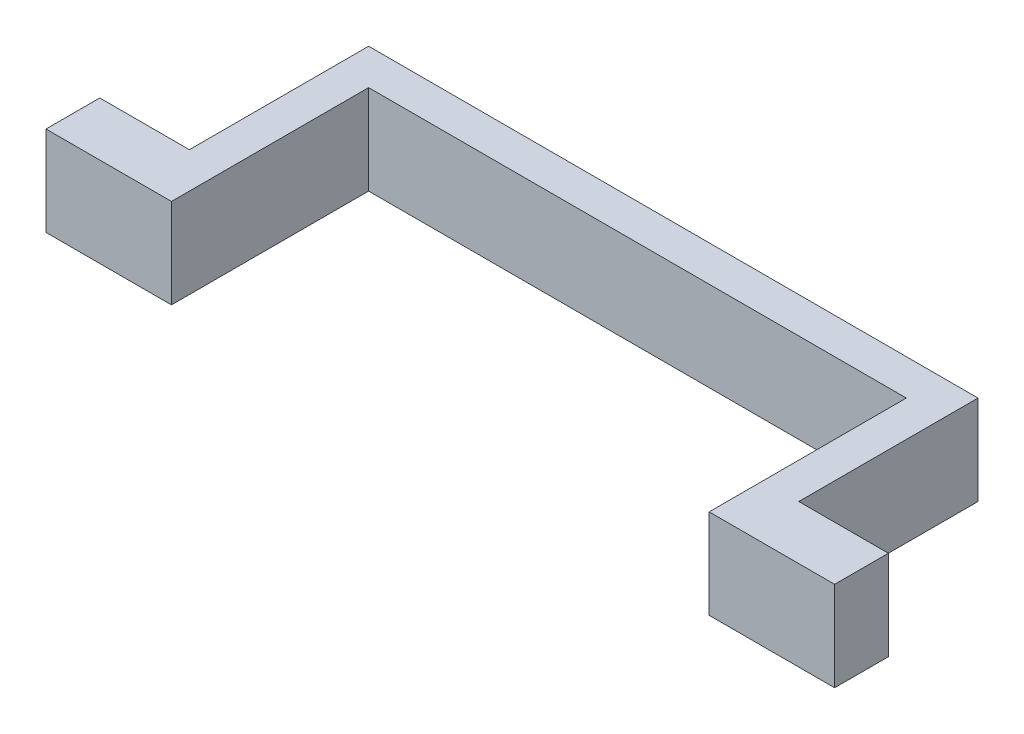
ISO-10303-21;
HEADER;
FILE_DESCRIPTION(('STEP AP214'),'2;1');
FILE_NAME('part.step','',(''),(''),'','','');
FILE_SCHEMA(('AUTOMOTIVE_DESIGN { 1 0 10303 214 1 1 1 1 }'));
ENDSEC;
DATA;
#1=APPLICATION_CONTEXT('core data for automotive mechanical design processes');
#2=APPLICATION_PROTOCOL_DEFINITION('international standard','automotive_design',2000,#1);
#3=PRODUCT_CONTEXT('',#1,'mechanical');
#4=PRODUCT('Part','Part','',(#3));
#5=PRODUCT_RELATED_PRODUCT_CATEGORY('part','',(#4));
#6=PRODUCT_DEFINITION_FORMATION('','',#4);
#7=PRODUCT_DEFINITION_CONTEXT('part definition',#1,'design');
#8=PRODUCT_DEFINITION('design','',#6,#7);
#9=PRODUCT_DEFINITION_SHAPE('','',#8);
#10=(LENGTH_UNIT() NAMED_UNIT(*) SI_UNIT(.MILLI.,.METRE.));
#11=(NAMED_UNIT(*) PLANE_ANGLE_UNIT() SI_UNIT($,.RADIAN.));
#12=(NAMED_UNIT(*) SI_UNIT($,.STERADIAN.) SOLID_ANGLE_UNIT());
#13=UNCERTAINTY_MEASURE_WITH_UNIT(LENGTH_MEASURE(1.E-05),#10,'distance_accuracy_value','');
#14=(GEOMETRIC_REPRESENTATION_CONTEXT(3) GLOBAL_UNCERTAINTY_ASSIGNED_CONTEXT((#13)) GLOBAL_UNIT_ASSIGNED_CONTEXT((#10,
#11,#12)) REPRESENTATION_CONTEXT('',''));
#15=CARTESIAN_POINT('',(0.,0.,0.));
#16=DIRECTION('',(0.,0.,1.));
#17=DIRECTION('',(1.,0.,0.));
#18=AXIS2_PLACEMENT_3D('',#15,#16,#17);
#19=CARTESIAN_POINT('',(11.3973290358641,-3.51084583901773,2.));
#20=DIRECTION('',(0.,0.,-1.));
#21=DIRECTION('',(-1.,0.,0.));
#22=AXIS2_PLACEMENT_3D('',#19,#20,#21);
#23=PLANE('',#22);
#24=DIRECTION('',(0.,-1.,0.));
#25=VECTOR('',#24,1.);
#26=CARTESIAN_POINT('',(43.3973290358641,-8.51084583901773,2.));
#27=LINE('',#26,#25);
#28=CARTESIAN_POINT('',(43.3973290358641,-3.51084583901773,2.));
#29=VERTEX_POINT('',#28);
#30=CARTESIAN_POINT('',(43.3973290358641,-8.51084583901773,2.));
#31=VERTEX_POINT('',#30);
#32=EDGE_CURVE('E203',#29,#31,#27,.T.);
#33=ORIENTED_EDGE('',*,*,#32,.F.);
#34=DIRECTION('',(-1.,0.,0.));
#35=VECTOR('',#34,1.);
#36=CARTESIAN_POINT('',(11.3973290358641,-3.51084583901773,2.));
#37=LINE('',#36,#35);
#38=CARTESIAN_POINT('',(13.3973290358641,-3.51084583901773,2.));
#39=VERTEX_POINT('',#38);
#40=EDGE_CURVE('E164',#29,#39,#37,.T.);
#41=ORIENTED_EDGE('',*,*,#40,.T.);
#42=DIRECTION('',(0.,1.,0.));
#43=VECTOR('',#42,1.);
#44=CARTESIAN_POINT('',(13.3973290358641,-3.51084583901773,2.));
#45=LINE('',#44,#43);
#46=CARTESIAN_POINT('',(13.3973290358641,-8.51084583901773,2.));
#47=VERTEX_POINT('',#46);
#48=EDGE_CURVE('E221',#47,#39,#45,.T.);
#49=ORIENTED_EDGE('',*,*,#48,.F.);
#50=DIRECTION('',(1.,0.,0.));
#51=VECTOR('',#50,1.);
#52=CARTESIAN_POINT('',(11.3973290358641,-8.51084583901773,2.));
#53=LINE('',#52,#51);
#54=EDGE_CURVE('E179',#47,#31,#53,.T.);
#55=ORIENTED_EDGE('',*,*,#54,.T.);
#56=EDGE_LOOP('',(#33,#41,#49,#55));
#57=FACE_BOUND('',#56,.T.);
#58=ADVANCED_FACE('F33',(#57),#23,.F.);
#59=CARTESIAN_POINT('',(11.3973290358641,-8.51084583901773,2.));
#60=DIRECTION('',(1.,0.,0.));
#61=DIRECTION('',(0.,0.,-1.));
#62=AXIS2_PLACEMENT_3D('',#59,#60,#61);
#63=PLANE('',#62);
#64=DIRECTION('',(0.,0.,-1.));
#65=VECTOR('',#64,1.);
#66=CARTESIAN_POINT('',(11.3973290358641,-8.51084583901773,2.));
#67=LINE('',#66,#65);
#68=CARTESIAN_POINT('',(11.3973290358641,-8.51084583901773,10.));
#69=VERTEX_POINT('',#68);
#70=CARTESIAN_POINT('',(11.3973290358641,-8.51084583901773,0.));
#71=VERTEX_POINT('',#70);
#72=EDGE_CURVE('E11',#69,#71,#67,.T.);
#73=ORIENTED_EDGE('',*,*,#72,.F.);
#74=DIRECTION('',(0.,1.,0.));
#75=VECTOR('',#74,1.);
#76=CARTESIAN_POINT('',(11.3973290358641,-3.51084583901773,10.));
#77=LINE('',#76,#75);
#78=CARTESIAN_POINT('',(11.3973290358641,-3.51084583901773,10.));
#79=VERTEX_POINT('',#78);
#80=EDGE_CURVE('E186',#69,#79,#77,.T.);
#81=ORIENTED_EDGE('',*,*,#80,.T.);
#82=DIRECTION('',(0.,0.,-1.));
#83=VECTOR('',#82,1.);
#84=CARTESIAN_POINT('',(11.3973290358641,-3.51084583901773,2.));
#85=LINE('',#84,#83);
#86=CARTESIAN_POINT('',(11.3973290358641,-3.51084583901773,0.));
#87=VERTEX_POINT('',#86);
#88=EDGE_CURVE('E162',#79,#87,#85,.T.);
#89=ORIENTED_EDGE('',*,*,#88,.T.);
#90=DIRECTION('',(0.,-1.,0.));
#91=VECTOR('',#90,1.);
#92=CARTESIAN_POINT('',(11.3973290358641,-8.51084583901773,0.));
#93=LINE('',#92,#91);
#94=EDGE_CURVE('E239',#87,#71,#93,.T.);
#95=ORIENTED_EDGE('',*,*,#94,.T.);
#96=EDGE_LOOP('',(#73,#81,#89,#95));
#97=FACE_BOUND('',#96,.T.);
#98=ADVANCED_FACE('F35',(#97),#63,.F.);
#99=CARTESIAN_POINT('',(11.3973290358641,-8.51084583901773,2.));
#100=DIRECTION('',(0.,1.,0.));
#101=DIRECTION('',(0.,0.,1.));
#102=AXIS2_PLACEMENT_3D('',#99,#100,#101);
#103=PLANE('',#102);
#104=DIRECTION('',(1.,0.,0.));
#105=VECTOR('',#104,1.);
#106=CARTESIAN_POINT('',(11.3973290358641,-8.51084583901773,0.));
#107=LINE('',#106,#105);
#108=CARTESIAN_POINT('',(45.3973290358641,-8.51084583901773,0.));
#109=VERTEX_POINT('',#108);
#110=EDGE_CURVE('E245',#71,#109,#107,.T.);
#111=ORIENTED_EDGE('',*,*,#110,.T.);
#112=DIRECTION('',(0.,0.,-1.));
#113=VECTOR('',#112,1.);
#114=CARTESIAN_POINT('',(45.3973290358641,-8.51084583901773,2.));
#115=LINE('',#114,#113);
#116=CARTESIAN_POINT('',(45.3973290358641,-8.51084583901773,10.));
#117=VERTEX_POINT('',#116);
#118=EDGE_CURVE('E42',#117,#109,#115,.T.);
#119=ORIENTED_EDGE('',*,*,#118,.F.);
#120=DIRECTION('',(1.,0.,0.));
#121=VECTOR('',#120,1.);
#122=CARTESIAN_POINT('',(45.3973290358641,-8.51084583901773,10.));
#123=LINE('',#122,#121);
#124=CARTESIAN_POINT('',(50.3973290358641,-8.51084583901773,10.));
#125=VERTEX_POINT('',#124);
#126=EDGE_CURVE('E50',#117,#125,#123,.T.);
#127=ORIENTED_EDGE('',*,*,#126,.T.);
#128=DIRECTION('',(0.,0.,1.));
#129=VECTOR('',#128,1.);
#130=CARTESIAN_POINT('',(50.3973290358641,-8.51084583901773,10.));
#131=LINE('',#130,#129);
#132=CARTESIAN_POINT('',(50.3973290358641,-8.51084583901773,13.));
#133=VERTEX_POINT('',#132);
#134=EDGE_CURVE('E126',#125,#133,#131,.T.);
#135=ORIENTED_EDGE('',*,*,#134,.T.);
#136=DIRECTION('',(1.,0.,0.));
#137=VECTOR('',#136,1.);
#138=CARTESIAN_POINT('',(45.3973290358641,-8.51084583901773,13.));
#139=LINE('',#138,#137);
#140=CARTESIAN_POINT('',(43.3973290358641,-8.51084583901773,13.));
#141=VERTEX_POINT('',#140);
#142=EDGE_CURVE('E211',#141,#133,#139,.T.);
#143=ORIENTED_EDGE('',*,*,#142,.F.);
#144=DIRECTION('',(0.,0.,-1.));
#145=VECTOR('',#144,1.);
#146=CARTESIAN_POINT('',(43.3973290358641,-8.51084583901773,13.));
#147=LINE('',#146,#145);
#148=EDGE_CURVE('E213',#141,#31,#147,.T.);
#149=ORIENTED_EDGE('',*,*,#148,.T.);
#150=ORIENTED_EDGE('',*,*,#54,.F.);
#151=DIRECTION('',(0.,0.,-1.));
#152=VECTOR('',#151,1.);
#153=CARTESIAN_POINT('',(13.3973290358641,-8.51084583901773,13.));
#154=LINE('',#153,#152);
#155=CARTESIAN_POINT('',(13.3973290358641,-8.51084583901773,13.));
#156=VERTEX_POINT('',#155);
#157=EDGE_CURVE('E235',#156,#47,#154,.T.);
#158=ORIENTED_EDGE('',*,*,#157,.F.);
#159=DIRECTION('',(1.,0.,0.));
#160=VECTOR('',#159,1.);
#161=CARTESIAN_POINT('',(11.3973290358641,-8.51084583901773,13.));
#162=LINE('',#161,#160);
#163=CARTESIAN_POINT('',(6.39732903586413,-8.51084583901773,13.));
#164=VERTEX_POINT('',#163);
#165=EDGE_CURVE('E222',#164,#156,#162,.T.);
#166=ORIENTED_EDGE('',*,*,#165,.F.);
#167=DIRECTION('',(0.,0.,1.));
#168=VECTOR('',#167,1.);
#169=CARTESIAN_POINT('',(6.39732903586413,-8.51084583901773,10.));
#170=LINE('',#169,#168);
#171=CARTESIAN_POINT('',(6.39732903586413,-8.51084583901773,10.));
#172=VERTEX_POINT('',#171);
#173=EDGE_CURVE('E200',#172,#164,#170,.T.);
#174=ORIENTED_EDGE('',*,*,#173,.F.);
#175=DIRECTION('',(1.,0.,0.));
#176=VECTOR('',#175,1.);
#177=CARTESIAN_POINT('',(11.3973290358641,-8.51084583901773,10.));
#178=LINE('',#177,#176);
#179=EDGE_CURVE('E197',#172,#69,#178,.T.);
#180=ORIENTED_EDGE('',*,*,#179,.T.);
#181=ORIENTED_EDGE('',*,*,#72,.T.);
#182=EDGE_LOOP('',(#111,#119,#127,#135,#143,#149,#150,#158,#166,#174,#180,#181));
#183=FACE_BOUND('',#182,.T.);
#184=ADVANCED_FACE('F143',(#183),#103,.F.);
#185=CARTESIAN_POINT('',(45.3973290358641,-8.51084583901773,2.));
#186=DIRECTION('',(-1.,0.,0.));
#187=DIRECTION('',(0.,0.,1.));
#188=AXIS2_PLACEMENT_3D('',#185,#186,#187);
#189=PLANE('',#188);
#190=DIRECTION('',(0.,0.,-1.));
#191=VECTOR('',#190,1.);
#192=CARTESIAN_POINT('',(45.3973290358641,-3.51084583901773,2.));
#193=LINE('',#192,#191);
#194=CARTESIAN_POINT('',(45.3973290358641,-3.51084583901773,10.));
#195=VERTEX_POINT('',#194);
#196=CARTESIAN_POINT('',(45.3973290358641,-3.51084583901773,0.));
#197=VERTEX_POINT('',#196);
#198=EDGE_CURVE('E155',#195,#197,#193,.T.);
#199=ORIENTED_EDGE('',*,*,#198,.F.);
#200=DIRECTION('',(0.,-1.,0.));
#201=VECTOR('',#200,1.);
#202=CARTESIAN_POINT('',(45.3973290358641,-3.51084583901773,10.));
#203=LINE('',#202,#201);
#204=EDGE_CURVE('E144',#195,#117,#203,.T.);
#205=ORIENTED_EDGE('',*,*,#204,.T.);
#206=ORIENTED_EDGE('',*,*,#118,.T.);
#207=DIRECTION('',(0.,1.,0.));
#208=VECTOR('',#207,1.);
#209=CARTESIAN_POINT('',(45.3973290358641,-8.51084583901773,0.));
#210=LINE('',#209,#208);
#211=EDGE_CURVE('E160',#109,#197,#210,.T.);
#212=ORIENTED_EDGE('',*,*,#211,.T.);
#213=EDGE_LOOP('',(#199,#205,#206,#212));
#214=FACE_BOUND('',#213,.T.);
#215=ADVANCED_FACE('F158',(#214),#189,.F.);
#216=CARTESIAN_POINT('',(11.3973290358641,-3.51084583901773,2.));
#217=DIRECTION('',(0.,-1.,0.));
#218=DIRECTION('',(0.,0.,-1.));
#219=AXIS2_PLACEMENT_3D('',#216,#217,#218);
#220=PLANE('',#219);
#221=DIRECTION('',(-1.,0.,0.));
#222=VECTOR('',#221,1.);
#223=CARTESIAN_POINT('',(11.3973290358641,-3.51084583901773,0.));
#224=LINE('',#223,#222);
#225=EDGE_CURVE('E253',#197,#87,#224,.T.);
#226=ORIENTED_EDGE('',*,*,#225,.T.);
#227=ORIENTED_EDGE('',*,*,#88,.F.);
#228=DIRECTION('',(-1.,0.,0.));
#229=VECTOR('',#228,1.);
#230=CARTESIAN_POINT('',(11.3973290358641,-3.51084583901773,10.));
#231=LINE('',#230,#229);
#232=CARTESIAN_POINT('',(6.39732903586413,-3.51084583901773,10.));
#233=VERTEX_POINT('',#232);
#234=EDGE_CURVE('E58',#79,#233,#231,.T.);
#235=ORIENTED_EDGE('',*,*,#234,.T.);
#236=DIRECTION('',(0.,0.,1.));
#237=VECTOR('',#236,1.);
#238=CARTESIAN_POINT('',(6.39732903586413,-3.51084583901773,10.));
#239=LINE('',#238,#237);
#240=CARTESIAN_POINT('',(6.39732903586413,-3.51084583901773,13.));
#241=VERTEX_POINT('',#240);
#242=EDGE_CURVE('E204',#233,#241,#239,.T.);
#243=ORIENTED_EDGE('',*,*,#242,.T.);
#244=DIRECTION('',(-1.,0.,0.));
#245=VECTOR('',#244,1.);
#246=CARTESIAN_POINT('',(11.3973290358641,-3.51084583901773,13.));
#247=LINE('',#246,#245);
#248=CARTESIAN_POINT('',(13.3973290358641,-3.51084583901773,13.));
#249=VERTEX_POINT('',#248);
#250=EDGE_CURVE('E226',#249,#241,#247,.T.);
#251=ORIENTED_EDGE('',*,*,#250,.F.);
#252=DIRECTION('',(0.,0.,-1.));
#253=VECTOR('',#252,1.);
#254=CARTESIAN_POINT('',(13.3973290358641,-3.51084583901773,13.));
#255=LINE('',#254,#253);
#256=EDGE_CURVE('E228',#249,#39,#255,.T.);
#257=ORIENTED_EDGE('',*,*,#256,.T.);
#258=ORIENTED_EDGE('',*,*,#40,.F.);
#259=DIRECTION('',(0.,0.,-1.));
#260=VECTOR('',#259,1.);
#261=CARTESIAN_POINT('',(43.3973290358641,-3.51084583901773,13.));
#262=LINE('',#261,#260);
#263=CARTESIAN_POINT('',(43.3973290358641,-3.51084583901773,13.));
#264=VERTEX_POINT('',#263);
#265=EDGE_CURVE('E218',#264,#29,#262,.T.);
#266=ORIENTED_EDGE('',*,*,#265,.F.);
#267=DIRECTION('',(-1.,0.,0.));
#268=VECTOR('',#267,1.);
#269=CARTESIAN_POINT('',(45.3973290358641,-3.51084583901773,13.));
#270=LINE('',#269,#268);
#271=CARTESIAN_POINT('',(50.3973290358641,-3.51084583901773,13.));
#272=VERTEX_POINT('',#271);
#273=EDGE_CURVE('E207',#272,#264,#270,.T.);
#274=ORIENTED_EDGE('',*,*,#273,.F.);
#275=DIRECTION('',(0.,0.,1.));
#276=VECTOR('',#275,1.);
#277=CARTESIAN_POINT('',(50.3973290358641,-3.51084583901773,10.));
#278=LINE('',#277,#276);
#279=CARTESIAN_POINT('',(50.3973290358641,-3.51084583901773,10.));
#280=VERTEX_POINT('',#279);
#281=EDGE_CURVE('E135',#280,#272,#278,.T.);
#282=ORIENTED_EDGE('',*,*,#281,.F.);
#283=DIRECTION('',(-1.,0.,0.));
#284=VECTOR('',#283,1.);
#285=CARTESIAN_POINT('',(45.3973290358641,-3.51084583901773,10.));
#286=LINE('',#285,#284);
#287=EDGE_CURVE('E136',#280,#195,#286,.T.);
#288=ORIENTED_EDGE('',*,*,#287,.T.);
#289=ORIENTED_EDGE('',*,*,#198,.T.);
#290=EDGE_LOOP('',(#226,#227,#235,#243,#251,#257,#258,#266,#274,#282,#288,#289));
#291=FACE_BOUND('',#290,.T.);
#292=ADVANCED_FACE('F154',(#291),#220,.F.);
#293=CARTESIAN_POINT('',(11.3973290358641,-3.51084583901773,0.));
#294=DIRECTION('',(0.,0.,-1.));
#295=DIRECTION('',(-1.,0.,0.));
#296=AXIS2_PLACEMENT_3D('',#293,#294,#295);
#297=PLANE('',#296);
#298=ORIENTED_EDGE('',*,*,#94,.F.);
#299=ORIENTED_EDGE('',*,*,#225,.F.);
#300=ORIENTED_EDGE('',*,*,#211,.F.);
#301=ORIENTED_EDGE('',*,*,#110,.F.);
#302=EDGE_LOOP('',(#298,#299,#300,#301));
#303=FACE_BOUND('',#302,.T.);
#304=ADVANCED_FACE('F292',(#303),#297,.T.);
#305=CARTESIAN_POINT('',(13.3973290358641,-3.51084583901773,13.));
#306=DIRECTION('',(-1.,0.,0.));
#307=DIRECTION('',(0.,-1.,0.));
#308=AXIS2_PLACEMENT_3D('',#305,#306,#307);
#309=PLANE('',#308);
#310=ORIENTED_EDGE('',*,*,#48,.T.);
#311=ORIENTED_EDGE('',*,*,#256,.F.);
#312=DIRECTION('',(0.,1.,0.));
#313=VECTOR('',#312,1.);
#314=CARTESIAN_POINT('',(13.3973290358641,-3.51084583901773,13.));
#315=LINE('',#314,#313);
#316=EDGE_CURVE('E224',#156,#249,#315,.T.);
#317=ORIENTED_EDGE('',*,*,#316,.F.);
#318=ORIENTED_EDGE('',*,*,#157,.T.);
#319=EDGE_LOOP('',(#310,#311,#317,#318));
#320=FACE_BOUND('',#319,.T.);
#321=ADVANCED_FACE('F260',(#320),#309,.F.);
#322=CARTESIAN_POINT('',(11.3973290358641,-8.51084583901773,13.));
#323=DIRECTION('',(0.,0.,1.));
#324=DIRECTION('',(1.,0.,0.));
#325=AXIS2_PLACEMENT_3D('',#322,#323,#324);
#326=PLANE('',#325);
#327=ORIENTED_EDGE('',*,*,#250,.T.);
#328=DIRECTION('',(0.,-1.,0.));
#329=VECTOR('',#328,1.);
#330=CARTESIAN_POINT('',(6.39732903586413,-3.51084583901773,13.));
#331=LINE('',#330,#329);
#332=EDGE_CURVE('E189',#241,#164,#331,.T.);
#333=ORIENTED_EDGE('',*,*,#332,.T.);
#334=ORIENTED_EDGE('',*,*,#165,.T.);
#335=ORIENTED_EDGE('',*,*,#316,.T.);
#336=EDGE_LOOP('',(#327,#333,#334,#335));
#337=FACE_BOUND('',#336,.T.);
#338=ADVANCED_FACE('F264',(#337),#326,.T.);
#339=CARTESIAN_POINT('',(43.3973290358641,-8.51084583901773,13.));
#340=DIRECTION('',(1.,0.,0.));
#341=DIRECTION('',(0.,0.,-1.));
#342=AXIS2_PLACEMENT_3D('',#339,#340,#341);
#343=PLANE('',#342);
#344=ORIENTED_EDGE('',*,*,#32,.T.);
#345=ORIENTED_EDGE('',*,*,#148,.F.);
#346=DIRECTION('',(0.,-1.,0.));
#347=VECTOR('',#346,1.);
#348=CARTESIAN_POINT('',(43.3973290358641,-8.51084583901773,13.));
#349=LINE('',#348,#347);
#350=EDGE_CURVE('E209',#264,#141,#349,.T.);
#351=ORIENTED_EDGE('',*,*,#350,.F.);
#352=ORIENTED_EDGE('',*,*,#265,.T.);
#353=EDGE_LOOP('',(#344,#345,#351,#352));
#354=FACE_BOUND('',#353,.T.);
#355=ADVANCED_FACE('F268',(#354),#343,.F.);
#356=CARTESIAN_POINT('',(45.3973290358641,-3.51084583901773,13.));
#357=DIRECTION('',(0.,0.,1.));
#358=DIRECTION('',(1.,0.,0.));
#359=AXIS2_PLACEMENT_3D('',#356,#357,#358);
#360=PLANE('',#359);
#361=ORIENTED_EDGE('',*,*,#142,.T.);
#362=DIRECTION('',(0.,1.,0.));
#363=VECTOR('',#362,1.);
#364=CARTESIAN_POINT('',(50.3973290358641,-3.51084583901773,13.));
#365=LINE('',#364,#363);
#366=EDGE_CURVE('E132',#133,#272,#365,.T.);
#367=ORIENTED_EDGE('',*,*,#366,.T.);
#368=ORIENTED_EDGE('',*,*,#273,.T.);
#369=ORIENTED_EDGE('',*,*,#350,.T.);
#370=EDGE_LOOP('',(#361,#367,#368,#369));
#371=FACE_BOUND('',#370,.T.);
#372=ADVANCED_FACE('F270',(#371),#360,.T.);
#373=CARTESIAN_POINT('',(6.39732903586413,-3.51084583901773,10.));
#374=DIRECTION('',(-1.,0.,0.));
#375=DIRECTION('',(0.,0.,1.));
#376=AXIS2_PLACEMENT_3D('',#373,#374,#375);
#377=PLANE('',#376);
#378=ORIENTED_EDGE('',*,*,#332,.F.);
#379=ORIENTED_EDGE('',*,*,#242,.F.);
#380=DIRECTION('',(0.,-1.,0.));
#381=VECTOR('',#380,1.);
#382=CARTESIAN_POINT('',(6.39732903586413,-3.51084583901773,10.));
#383=LINE('',#382,#381);
#384=EDGE_CURVE('E194',#233,#172,#383,.T.);
#385=ORIENTED_EDGE('',*,*,#384,.T.);
#386=ORIENTED_EDGE('',*,*,#173,.T.);
#387=EDGE_LOOP('',(#378,#379,#385,#386));
#388=FACE_BOUND('',#387,.T.);
#389=ADVANCED_FACE('F274',(#388),#377,.T.);
#390=CARTESIAN_POINT('',(11.3973290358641,-8.51084583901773,10.));
#391=DIRECTION('',(0.,0.,-1.));
#392=DIRECTION('',(-1.,0.,0.));
#393=AXIS2_PLACEMENT_3D('',#390,#391,#392);
#394=PLANE('',#393);
#395=ORIENTED_EDGE('',*,*,#80,.F.);
#396=ORIENTED_EDGE('',*,*,#179,.F.);
#397=ORIENTED_EDGE('',*,*,#384,.F.);
#398=ORIENTED_EDGE('',*,*,#234,.F.);
#399=EDGE_LOOP('',(#395,#396,#397,#398));
#400=FACE_BOUND('',#399,.T.);
#401=ADVANCED_FACE('F280',(#400),#394,.T.);
#402=CARTESIAN_POINT('',(50.3973290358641,-3.51084583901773,10.));
#403=DIRECTION('',(1.,0.,0.));
#404=DIRECTION('',(0.,0.,-1.));
#405=AXIS2_PLACEMENT_3D('',#402,#403,#404);
#406=PLANE('',#405);
#407=ORIENTED_EDGE('',*,*,#366,.F.);
#408=ORIENTED_EDGE('',*,*,#134,.F.);
#409=DIRECTION('',(0.,1.,0.));
#410=VECTOR('',#409,1.);
#411=CARTESIAN_POINT('',(50.3973290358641,-3.51084583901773,10.));
#412=LINE('',#411,#410);
#413=EDGE_CURVE('E129',#125,#280,#412,.T.);
#414=ORIENTED_EDGE('',*,*,#413,.T.);
#415=ORIENTED_EDGE('',*,*,#281,.T.);
#416=EDGE_LOOP('',(#407,#408,#414,#415));
#417=FACE_BOUND('',#416,.T.);
#418=ADVANCED_FACE('F127',(#417),#406,.T.);
#419=CARTESIAN_POINT('',(45.3973290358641,-8.51084583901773,10.));
#420=DIRECTION('',(0.,0.,1.));
#421=DIRECTION('',(1.,0.,0.));
#422=AXIS2_PLACEMENT_3D('',#419,#420,#421);
#423=PLANE('',#422);
#424=ORIENTED_EDGE('',*,*,#204,.F.);
#425=ORIENTED_EDGE('',*,*,#287,.F.);
#426=ORIENTED_EDGE('',*,*,#413,.F.);
#427=ORIENTED_EDGE('',*,*,#126,.F.);
#428=EDGE_LOOP('',(#424,#425,#426,#427));
#429=FACE_BOUND('',#428,.T.);
#430=ADVANCED_FACE('F138',(#429),#423,.F.);
#431=CLOSED_SHELL('',(#58,#98,#184,#215,#292,#304,#321,#338,#355,#372,#389,#401,#418,#430));
#432=MANIFOLD_SOLID_BREP('B2',#431);
#433=ADVANCED_BREP_SHAPE_REPRESENTATION('',(#18,#432),#14);
#434=SHAPE_DEFINITION_REPRESENTATION(#9,#433);
ENDSEC;
END-ISO-10303-21;
